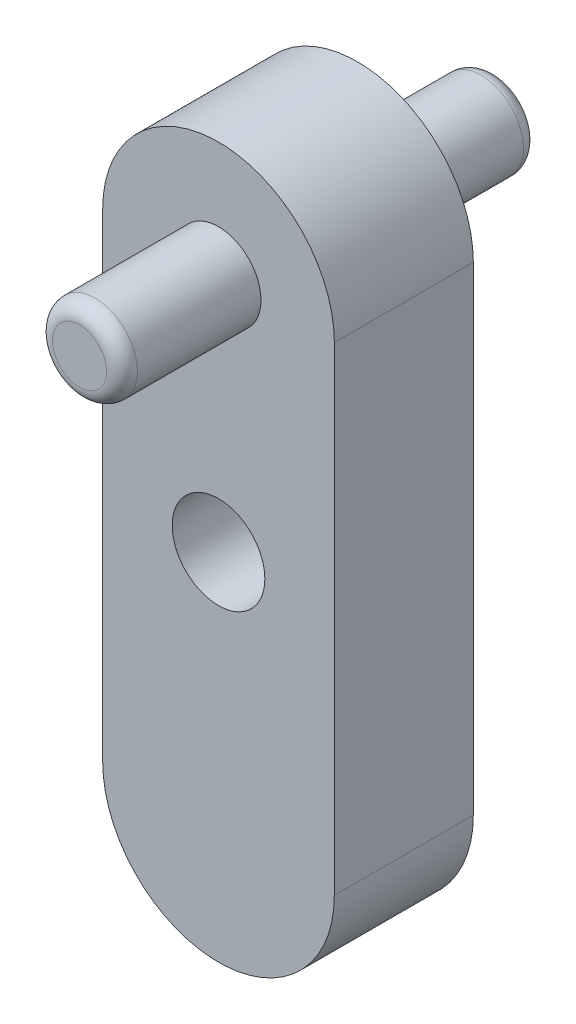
ISO-10303-21;
HEADER;
FILE_DESCRIPTION(('STEP AP214'),'2;1');
FILE_NAME('part.step','',(''),(''),'','','');
FILE_SCHEMA(('AUTOMOTIVE_DESIGN { 1 0 10303 214 1 1 1 1 }'));
ENDSEC;
DATA;
#1=APPLICATION_CONTEXT('core data for automotive mechanical design processes');
#2=APPLICATION_PROTOCOL_DEFINITION('international standard','automotive_design',2000,#1);
#3=PRODUCT_CONTEXT('',#1,'mechanical');
#4=PRODUCT('Part','Part','',(#3));
#5=PRODUCT_RELATED_PRODUCT_CATEGORY('part','',(#4));
#6=PRODUCT_DEFINITION_FORMATION('','',#4);
#7=PRODUCT_DEFINITION_CONTEXT('part definition',#1,'design');
#8=PRODUCT_DEFINITION('design','',#6,#7);
#9=PRODUCT_DEFINITION_SHAPE('','',#8);
#10=(LENGTH_UNIT() NAMED_UNIT(*) SI_UNIT(.MILLI.,.METRE.));
#11=(NAMED_UNIT(*) PLANE_ANGLE_UNIT() SI_UNIT($,.RADIAN.));
#12=(NAMED_UNIT(*) SI_UNIT($,.STERADIAN.) SOLID_ANGLE_UNIT());
#13=UNCERTAINTY_MEASURE_WITH_UNIT(LENGTH_MEASURE(1.E-05),#10,'distance_accuracy_value','');
#14=(GEOMETRIC_REPRESENTATION_CONTEXT(3) GLOBAL_UNCERTAINTY_ASSIGNED_CONTEXT((#13)) GLOBAL_UNIT_ASSIGNED_CONTEXT((#10,
#11,#12)) REPRESENTATION_CONTEXT('',''));
#15=CARTESIAN_POINT('',(0.,0.,0.));
#16=DIRECTION('',(0.,0.,1.));
#17=DIRECTION('',(1.,0.,0.));
#18=AXIS2_PLACEMENT_3D('',#15,#16,#17);
#19=CARTESIAN_POINT('',(-85.,60.5000000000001,141.));
#20=DIRECTION('',(0.,0.,1.));
#21=DIRECTION('',(1.,0.,0.));
#22=AXIS2_PLACEMENT_3D('',#19,#20,#21);
#23=CYLINDRICAL_SURFACE('',#22,2.75000000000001);
#24=CARTESIAN_POINT('',(-85.,60.5000000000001,167.));
#25=DIRECTION('',(0.,0.,-1.));
#26=DIRECTION('',(-1.,0.,0.));
#27=AXIS2_PLACEMENT_3D('',#24,#25,#26);
#28=CIRCLE('',#27,2.75000000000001);
#29=CARTESIAN_POINT('',(-87.75,60.5000000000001,167.));
#30=VERTEX_POINT('',#29);
#31=EDGE_CURVE('E49',#30,#30,#28,.T.);
#32=ORIENTED_EDGE('',*,*,#31,.T.);
#33=EDGE_LOOP('',(#32));
#34=FACE_BOUND('',#33,.T.);
#35=CARTESIAN_POINT('',(-85.,60.5000000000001,142.));
#36=DIRECTION('',(0.,0.,-1.));
#37=DIRECTION('',(0.,-1.,0.));
#38=AXIS2_PLACEMENT_3D('',#35,#36,#37);
#39=CIRCLE('',#38,2.75000000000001);
#40=CARTESIAN_POINT('',(-85.,57.7500000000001,142.));
#41=VERTEX_POINT('',#40);
#42=EDGE_CURVE('E53',#41,#41,#39,.F.);
#43=ORIENTED_EDGE('',*,*,#42,.T.);
#44=EDGE_LOOP('',(#43));
#45=FACE_BOUND('',#44,.T.);
#46=ADVANCED_FACE('F42',(#34,#45),#23,.T.);
#47=CARTESIAN_POINT('',(-85.,60.5000000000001,141.));
#48=DIRECTION('',(0.,0.,-1.));
#49=DIRECTION('',(-1.,0.,0.));
#50=AXIS2_PLACEMENT_3D('',#47,#48,#49);
#51=PLANE('',#50);
#52=CARTESIAN_POINT('',(-85.,60.5000000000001,141.));
#53=DIRECTION('',(0.,0.,-1.));
#54=DIRECTION('',(0.,-1.,0.));
#55=AXIS2_PLACEMENT_3D('',#52,#53,#54);
#56=CIRCLE('',#55,1.75000000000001);
#57=CARTESIAN_POINT('',(-85.,58.7500000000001,141.));
#58=VERTEX_POINT('',#57);
#59=EDGE_CURVE('E57',#58,#58,#56,.T.);
#60=ORIENTED_EDGE('',*,*,#59,.T.);
#61=EDGE_LOOP('',(#60));
#62=FACE_BOUND('',#61,.T.);
#63=ADVANCED_FACE('F63',(#62),#51,.T.);
#64=CARTESIAN_POINT('',(-85.,60.5000000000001,168.));
#65=DIRECTION('',(0.,0.,-1.));
#66=DIRECTION('',(-1.,0.,0.));
#67=AXIS2_PLACEMENT_3D('',#64,#65,#66);
#68=PLANE('',#67);
#69=CARTESIAN_POINT('',(-85.,60.5000000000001,168.));
#70=DIRECTION('',(0.,0.,-1.));
#71=DIRECTION('',(-1.,0.,0.));
#72=AXIS2_PLACEMENT_3D('',#69,#70,#71);
#73=CIRCLE('',#72,1.75000000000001);
#74=CARTESIAN_POINT('',(-86.75,60.5000000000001,168.));
#75=VERTEX_POINT('',#74);
#76=EDGE_CURVE('E11',#75,#75,#73,.F.);
#77=ORIENTED_EDGE('',*,*,#76,.T.);
#78=EDGE_LOOP('',(#77));
#79=FACE_BOUND('',#78,.T.);
#80=ADVANCED_FACE('F67',(#79),#68,.F.);
#81=CARTESIAN_POINT('',(-85.,60.5000000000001,142.));
#82=DIRECTION('',(0.,0.,-1.));
#83=DIRECTION('',(0.,-1.,0.));
#84=AXIS2_PLACEMENT_3D('',#81,#82,#83);
#85=TOROIDAL_SURFACE('',#84,1.75000000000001,1.);
#86=ORIENTED_EDGE('',*,*,#42,.F.);
#87=EDGE_LOOP('',(#86));
#88=FACE_BOUND('',#87,.T.);
#89=ORIENTED_EDGE('',*,*,#59,.F.);
#90=EDGE_LOOP('',(#89));
#91=FACE_BOUND('',#90,.T.);
#92=ADVANCED_FACE('F65',(#88,#91),#85,.T.);
#93=CARTESIAN_POINT('',(-85.,60.5000000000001,167.));
#94=DIRECTION('',(0.,0.,-1.));
#95=DIRECTION('',(-1.,0.,0.));
#96=AXIS2_PLACEMENT_3D('',#93,#94,#95);
#97=TOROIDAL_SURFACE('',#96,1.75000000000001,1.);
#98=ORIENTED_EDGE('',*,*,#76,.F.);
#99=EDGE_LOOP('',(#98));
#100=FACE_BOUND('',#99,.T.);
#101=ORIENTED_EDGE('',*,*,#31,.F.);
#102=EDGE_LOOP('',(#101));
#103=FACE_BOUND('',#102,.T.);
#104=ADVANCED_FACE('F44',(#100,#103),#97,.T.);
#105=CLOSED_SHELL('',(#46,#63,#80,#92,#104));
#106=MANIFOLD_SOLID_BREP('B2',#105);
#107=CARTESIAN_POINT('',(-85.,60.5000000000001,159.));
#108=DIRECTION('',(0.,0.,-1.));
#109=DIRECTION('',(-1.,0.,0.));
#110=AXIS2_PLACEMENT_3D('',#107,#108,#109);
#111=CYLINDRICAL_SURFACE('',#110,7.49999999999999);
#112=CARTESIAN_POINT('',(-85.,60.5000000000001,150.));
#113=DIRECTION('',(0.,0.,1.));
#114=DIRECTION('',(1.,0.,0.));
#115=AXIS2_PLACEMENT_3D('',#112,#113,#114);
#116=CIRCLE('',#115,7.49999999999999);
#117=CARTESIAN_POINT('',(-77.5,60.5000000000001,150.));
#118=VERTEX_POINT('',#117);
#119=CARTESIAN_POINT('',(-92.5,60.5000000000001,150.));
#120=VERTEX_POINT('',#119);
#121=EDGE_CURVE('E177',#118,#120,#116,.T.);
#122=ORIENTED_EDGE('',*,*,#121,.T.);
#123=DIRECTION('',(0.,0.,-1.));
#124=VECTOR('',#123,1.);
#125=CARTESIAN_POINT('',(-92.5,60.5000000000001,159.));
#126=LINE('',#125,#124);
#127=CARTESIAN_POINT('',(-92.5,60.5000000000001,159.));
#128=VERTEX_POINT('',#127);
#129=EDGE_CURVE('E40',#128,#120,#126,.T.);
#130=ORIENTED_EDGE('',*,*,#129,.F.);
#131=CARTESIAN_POINT('',(-85.,60.5000000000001,159.));
#132=DIRECTION('',(0.,0.,1.));
#133=DIRECTION('',(1.,0.,0.));
#134=AXIS2_PLACEMENT_3D('',#131,#132,#133);
#135=CIRCLE('',#134,7.49999999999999);
#136=CARTESIAN_POINT('',(-77.5,60.5000000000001,159.));
#137=VERTEX_POINT('',#136);
#138=EDGE_CURVE('E164',#137,#128,#135,.T.);
#139=ORIENTED_EDGE('',*,*,#138,.F.);
#140=DIRECTION('',(0.,0.,-1.));
#141=VECTOR('',#140,1.);
#142=CARTESIAN_POINT('',(-77.5,60.5000000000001,159.));
#143=LINE('',#142,#141);
#144=EDGE_CURVE('E173',#137,#118,#143,.T.);
#145=ORIENTED_EDGE('',*,*,#144,.T.);
#146=EDGE_LOOP('',(#122,#130,#139,#145));
#147=FACE_BOUND('',#146,.T.);
#148=ADVANCED_FACE('F112',(#147),#111,.T.);
#149=CARTESIAN_POINT('',(-92.5,60.5000000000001,159.));
#150=DIRECTION('',(1.,0.,0.));
#151=DIRECTION('',(0.,1.,0.));
#152=AXIS2_PLACEMENT_3D('',#149,#150,#151);
#153=PLANE('',#152);
#154=DIRECTION('',(0.,-1.,0.));
#155=VECTOR('',#154,1.);
#156=CARTESIAN_POINT('',(-92.5,60.5000000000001,150.));
#157=LINE('',#156,#155);
#158=CARTESIAN_POINT('',(-92.5,29.5000000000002,150.));
#159=VERTEX_POINT('',#158);
#160=EDGE_CURVE('E168',#120,#159,#157,.T.);
#161=ORIENTED_EDGE('',*,*,#160,.T.);
#162=DIRECTION('',(0.,0.,-1.));
#163=VECTOR('',#162,1.);
#164=CARTESIAN_POINT('',(-92.5,29.5000000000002,159.));
#165=LINE('',#164,#163);
#166=CARTESIAN_POINT('',(-92.5,29.5000000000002,159.));
#167=VERTEX_POINT('',#166);
#168=EDGE_CURVE('E121',#167,#159,#165,.T.);
#169=ORIENTED_EDGE('',*,*,#168,.F.);
#170=DIRECTION('',(0.,-1.,0.));
#171=VECTOR('',#170,1.);
#172=CARTESIAN_POINT('',(-92.5,60.5000000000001,159.));
#173=LINE('',#172,#171);
#174=EDGE_CURVE('E159',#128,#167,#173,.T.);
#175=ORIENTED_EDGE('',*,*,#174,.F.);
#176=ORIENTED_EDGE('',*,*,#129,.T.);
#177=EDGE_LOOP('',(#161,#169,#175,#176));
#178=FACE_BOUND('',#177,.T.);
#179=ADVANCED_FACE('F167',(#178),#153,.F.);
#180=CARTESIAN_POINT('',(-85.,29.5000000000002,159.));
#181=DIRECTION('',(0.,0.,-1.));
#182=DIRECTION('',(-1.,0.,0.));
#183=AXIS2_PLACEMENT_3D('',#180,#181,#182);
#184=CYLINDRICAL_SURFACE('',#183,7.5);
#185=CARTESIAN_POINT('',(-85.,29.5000000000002,150.));
#186=DIRECTION('',(0.,0.,1.));
#187=DIRECTION('',(1.,0.,0.));
#188=AXIS2_PLACEMENT_3D('',#185,#186,#187);
#189=CIRCLE('',#188,7.5);
#190=CARTESIAN_POINT('',(-77.5,29.5000000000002,150.));
#191=VERTEX_POINT('',#190);
#192=EDGE_CURVE('E146',#159,#191,#189,.T.);
#193=ORIENTED_EDGE('',*,*,#192,.T.);
#194=DIRECTION('',(0.,0.,-1.));
#195=VECTOR('',#194,1.);
#196=CARTESIAN_POINT('',(-77.5,29.5000000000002,159.));
#197=LINE('',#196,#195);
#198=CARTESIAN_POINT('',(-77.5,29.5000000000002,159.));
#199=VERTEX_POINT('',#198);
#200=EDGE_CURVE('E169',#199,#191,#197,.T.);
#201=ORIENTED_EDGE('',*,*,#200,.F.);
#202=CARTESIAN_POINT('',(-85.,29.5000000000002,159.));
#203=DIRECTION('',(0.,0.,1.));
#204=DIRECTION('',(1.,0.,0.));
#205=AXIS2_PLACEMENT_3D('',#202,#203,#204);
#206=CIRCLE('',#205,7.5);
#207=EDGE_CURVE('E162',#167,#199,#206,.T.);
#208=ORIENTED_EDGE('',*,*,#207,.F.);
#209=ORIENTED_EDGE('',*,*,#168,.T.);
#210=EDGE_LOOP('',(#193,#201,#208,#209));
#211=FACE_BOUND('',#210,.T.);
#212=ADVANCED_FACE('F171',(#211),#184,.T.);
#213=CARTESIAN_POINT('',(-77.5,60.5000000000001,159.));
#214=DIRECTION('',(-1.,0.,0.));
#215=DIRECTION('',(0.,0.,1.));
#216=AXIS2_PLACEMENT_3D('',#213,#214,#215);
#217=PLANE('',#216);
#218=DIRECTION('',(0.,1.,0.));
#219=VECTOR('',#218,1.);
#220=CARTESIAN_POINT('',(-77.5,60.5000000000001,150.));
#221=LINE('',#220,#219);
#222=EDGE_CURVE('E152',#191,#118,#221,.T.);
#223=ORIENTED_EDGE('',*,*,#222,.T.);
#224=ORIENTED_EDGE('',*,*,#144,.F.);
#225=DIRECTION('',(0.,1.,0.));
#226=VECTOR('',#225,1.);
#227=CARTESIAN_POINT('',(-77.5,60.5000000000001,159.));
#228=LINE('',#227,#226);
#229=EDGE_CURVE('E129',#199,#137,#228,.T.);
#230=ORIENTED_EDGE('',*,*,#229,.F.);
#231=ORIENTED_EDGE('',*,*,#200,.T.);
#232=EDGE_LOOP('',(#223,#224,#230,#231));
#233=FACE_BOUND('',#232,.T.);
#234=ADVANCED_FACE('F185',(#233),#217,.F.);
#235=CARTESIAN_POINT('',(-85.,60.5000000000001,159.));
#236=DIRECTION('',(0.,0.,1.));
#237=DIRECTION('',(1.,0.,0.));
#238=AXIS2_PLACEMENT_3D('',#235,#236,#237);
#239=PLANE('',#238);
#240=CARTESIAN_POINT('',(-85.,60.5000000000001,159.));
#241=DIRECTION('',(0.,0.,1.));
#242=DIRECTION('',(1.,0.,0.));
#243=AXIS2_PLACEMENT_3D('',#240,#241,#242);
#244=CIRCLE('',#243,2.75000000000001);
#245=CARTESIAN_POINT('',(-82.25,60.5000000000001,159.));
#246=VERTEX_POINT('',#245);
#247=EDGE_CURVE('E193',#246,#246,#244,.T.);
#248=ORIENTED_EDGE('',*,*,#247,.F.);
#249=EDGE_LOOP('',(#248));
#250=FACE_BOUND('',#249,.T.);
#251=CARTESIAN_POINT('',(-85.,45.0000000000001,159.));
#252=DIRECTION('',(0.,0.,1.));
#253=DIRECTION('',(1.,0.,0.));
#254=AXIS2_PLACEMENT_3D('',#251,#252,#253);
#255=CIRCLE('',#254,3.00000000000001);
#256=CARTESIAN_POINT('',(-82.,45.0000000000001,159.));
#257=VERTEX_POINT('',#256);
#258=EDGE_CURVE('E180',#257,#257,#255,.F.);
#259=ORIENTED_EDGE('',*,*,#258,.T.);
#260=EDGE_LOOP('',(#259));
#261=FACE_BOUND('',#260,.T.);
#262=ORIENTED_EDGE('',*,*,#138,.T.);
#263=ORIENTED_EDGE('',*,*,#174,.T.);
#264=ORIENTED_EDGE('',*,*,#207,.T.);
#265=ORIENTED_EDGE('',*,*,#229,.T.);
#266=EDGE_LOOP('',(#262,#263,#264,#265));
#267=FACE_BOUND('',#266,.T.);
#268=ADVANCED_FACE('F160',(#250,#261,#267),#239,.T.);
#269=CARTESIAN_POINT('',(-85.,60.5000000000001,150.));
#270=DIRECTION('',(0.,0.,1.));
#271=DIRECTION('',(1.,0.,0.));
#272=AXIS2_PLACEMENT_3D('',#269,#270,#271);
#273=PLANE('',#272);
#274=CARTESIAN_POINT('',(-85.,60.5000000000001,150.));
#275=DIRECTION('',(0.,0.,1.));
#276=DIRECTION('',(1.,0.,0.));
#277=AXIS2_PLACEMENT_3D('',#274,#275,#276);
#278=CIRCLE('',#277,2.75000000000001);
#279=CARTESIAN_POINT('',(-82.25,60.5000000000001,150.));
#280=VERTEX_POINT('',#279);
#281=EDGE_CURVE('E196',#280,#280,#278,.T.);
#282=ORIENTED_EDGE('',*,*,#281,.T.);
#283=EDGE_LOOP('',(#282));
#284=FACE_BOUND('',#283,.T.);
#285=CARTESIAN_POINT('',(-85.,45.0000000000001,150.));
#286=DIRECTION('',(0.,0.,1.));
#287=DIRECTION('',(1.,0.,0.));
#288=AXIS2_PLACEMENT_3D('',#285,#286,#287);
#289=CIRCLE('',#288,3.00000000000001);
#290=CARTESIAN_POINT('',(-82.,45.0000000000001,150.));
#291=VERTEX_POINT('',#290);
#292=EDGE_CURVE('E115',#291,#291,#289,.F.);
#293=ORIENTED_EDGE('',*,*,#292,.F.);
#294=EDGE_LOOP('',(#293));
#295=FACE_BOUND('',#294,.T.);
#296=ORIENTED_EDGE('',*,*,#121,.F.);
#297=ORIENTED_EDGE('',*,*,#222,.F.);
#298=ORIENTED_EDGE('',*,*,#192,.F.);
#299=ORIENTED_EDGE('',*,*,#160,.F.);
#300=EDGE_LOOP('',(#296,#297,#298,#299));
#301=FACE_BOUND('',#300,.T.);
#302=ADVANCED_FACE('F188',(#284,#295,#301),#273,.F.);
#303=CARTESIAN_POINT('',(-85.,45.0000000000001,159.5));
#304=DIRECTION('',(0.,0.,-1.));
#305=DIRECTION('',(-1.,0.,0.));
#306=AXIS2_PLACEMENT_3D('',#303,#304,#305);
#307=CYLINDRICAL_SURFACE('',#306,3.00000000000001);
#308=ORIENTED_EDGE('',*,*,#258,.F.);
#309=EDGE_LOOP('',(#308));
#310=FACE_BOUND('',#309,.T.);
#311=ORIENTED_EDGE('',*,*,#292,.T.);
#312=EDGE_LOOP('',(#311));
#313=FACE_BOUND('',#312,.T.);
#314=ADVANCED_FACE('F203',(#310,#313),#307,.F.);
#315=CARTESIAN_POINT('',(-85.,60.5000000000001,150.));
#316=DIRECTION('',(0.,0.,1.));
#317=DIRECTION('',(1.,0.,0.));
#318=AXIS2_PLACEMENT_3D('',#315,#316,#317);
#319=CYLINDRICAL_SURFACE('',#318,2.75000000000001);
#320=ORIENTED_EDGE('',*,*,#281,.F.);
#321=EDGE_LOOP('',(#320));
#322=FACE_BOUND('',#321,.T.);
#323=ORIENTED_EDGE('',*,*,#247,.T.);
#324=EDGE_LOOP('',(#323));
#325=FACE_BOUND('',#324,.T.);
#326=ADVANCED_FACE('F211',(#322,#325),#319,.F.);
#327=CLOSED_SHELL('',(#148,#179,#212,#234,#268,#302,#314,#326));
#328=MANIFOLD_SOLID_BREP('B6',#327);
#329=ADVANCED_BREP_SHAPE_REPRESENTATION('',(#18,#106,#328),#14);
#330=SHAPE_DEFINITION_REPRESENTATION(#9,#329);
ENDSEC;
END-ISO-10303-21;
